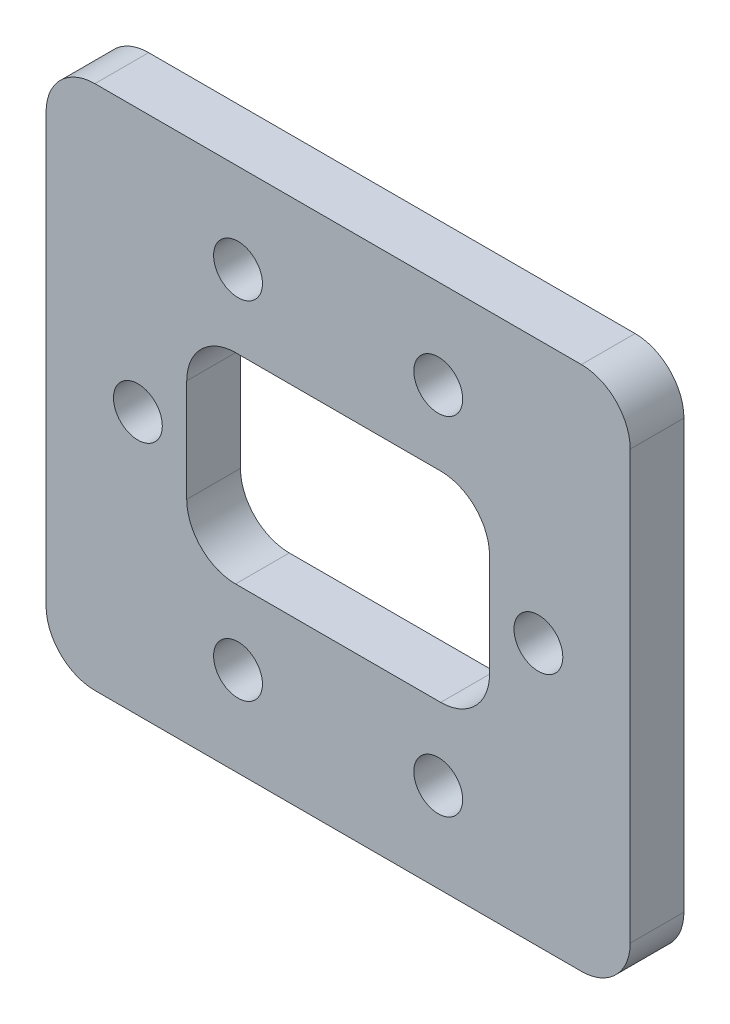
from build123d import *

# Parameters (mm, degrees)
SKETCH_1_R          = 2.5
EXTRUDE_1_DEPTH     = 5.5
CUT_EXTRUDE_START   = -10
CUT_EXTRUDE_1_DEPTH = 10


with BuildPart() as part:
    # Sketch 1 → Extrude 1 (new body)
    # profile 1 of 2: a face of its own
    with BuildSketch(Plane.XY):
        with BuildLine():
            Line((-28.87786877, 27.674760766), (30.92213123, 27.674760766))
            ThreePointArc((30.92213123, 27.674760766), (34.457665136, 26.210294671), (35.92213123, 22.674760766))
            Line((35.92213123, 22.674760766), (35.92213123, -21.125239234))
            ThreePointArc((35.92213123, -21.125239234), (34.457665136, -24.66077314), (30.92213123, -26.125239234))
            Line((30.92213123, -26.125239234), (-28.87786877, -26.125239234))
            ThreePointArc((-28.87786877, -26.125239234), (-32.413402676, -24.66077314), (-33.87786877, -21.125239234))
            Line((-33.87786877, -21.125239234), (-33.87786877, 22.674760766))
            ThreePointArc((-33.87786877, 22.674760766), (-32.413402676, 26.210294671), (-28.87786877, 27.674760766))
        make_face()
        with BuildLine():
            ThreePointArc((-14.47786877, 26.028281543), (-21.548936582, 23.099349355), (-24.47786877, 16.028281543))
            Line((-24.47786877, 16.028281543), (-24.47786877, -14.478760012))
            ThreePointArc((-24.47786877, -14.478760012), (-21.548936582, -21.549827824), (-14.47786877, -24.478760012))
            Line((-14.47786877, -24.478760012), (16.52213123, -24.478760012))
            ThreePointArc((16.52213123, -24.478760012), (23.593199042, -21.549827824), (26.52213123, -14.478760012))
            Line((26.52213123, -14.478760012), (26.52213123, 16.028281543))
            ThreePointArc((26.52213123, 16.028281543), (23.593199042, 23.099349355), (16.52213123, 26.028281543))
            Line((16.52213123, 26.028281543), (-14.47786877, 26.028281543))
        make_face(mode=Mode.SUBTRACT)
    # profile 2 of 2: a face of its own
    with BuildSketch(Plane.XY):
        with BuildLine():
            Line((-14.47786877, 26.028281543), (16.52213123, 26.028281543))
            ThreePointArc((16.52213123, 26.028281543), (23.593199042, 23.099349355), (26.52213123, 16.028281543))
            Line((26.52213123, 16.028281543), (26.52213123, -14.478760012))
            ThreePointArc((26.52213123, -14.478760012), (23.593199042, -21.549827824), (16.52213123, -24.478760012))
            Line((16.52213123, -24.478760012), (-14.47786877, -24.478760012))
            ThreePointArc((-14.47786877, -24.478760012), (-21.548936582, -21.549827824), (-24.47786877, -14.478760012))
            Line((-24.47786877, -14.478760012), (-24.47786877, 16.028281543))
            ThreePointArc((-24.47786877, 16.028281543), (-21.548936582, 23.099349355), (-14.47786877, 26.028281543))
        make_face()
        with Locations((-9.22786877, 18.528281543)):
            Circle(SKETCH_1_R, mode=Mode.SUBTRACT)
        with Locations((-9.22786877, -16.978760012)):
            Circle(SKETCH_1_R, mode=Mode.SUBTRACT)
        with Locations((11.27213123, -16.978760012)):
            Circle(SKETCH_1_R, mode=Mode.SUBTRACT)
        with Locations((11.27213123, 18.528281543)):
            Circle(SKETCH_1_R, mode=Mode.SUBTRACT)
        with Locations((21.52213123, 0.774760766)):
            Circle(SKETCH_1_R, mode=Mode.SUBTRACT)
        with Locations((-19.47786877, 0.774760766)):
            Circle(SKETCH_1_R, mode=Mode.SUBTRACT)
        with BuildLine():
            Line((-9.47786877, 11.028281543), (11.52213123, 11.028281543))
            ThreePointArc((11.52213123, 11.028281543), (15.057665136, 9.563815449), (16.52213123, 6.028281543))
            Line((16.52213123, 6.028281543), (16.52213123, -4.478760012))
            ThreePointArc((16.52213123, -4.478760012), (15.057665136, -8.014293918), (11.52213123, -9.478760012))
            Line((11.52213123, -9.478760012), (-9.47786877, -9.478760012))
            ThreePointArc((-9.47786877, -9.478760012), (-13.013402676, -8.014293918), (-14.47786877, -4.478760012))
            Line((-14.47786877, -4.478760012), (-14.47786877, 6.028281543))
            ThreePointArc((-14.47786877, 6.028281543), (-13.013402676, 9.563815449), (-9.47786877, 11.028281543))
        make_face(mode=Mode.SUBTRACT)
    extrude(amount=EXTRUDE_1_DEPTH)

    # Sketch 24 → Cut-Extrude 1 (cut)
    with BuildSketch(Plane.XY.offset(5.5).offset(CUT_EXTRUDE_START)):
        with BuildLine():
            Line((-28.87786877, -21.125239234), (-28.87786877, 22.674760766))
            ThreePointArc((-28.87786877, 22.674760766), (-27.413402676, 26.210294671), (-23.87786877, 27.674760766))
            Line((-23.87786877, 27.674760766), (-28.87786877, 27.674760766))
            ThreePointArc((-28.87786877, 27.674760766), (-32.413402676, 26.210294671), (-33.87786877, 22.674760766))
            Line((-33.87786877, 22.674760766), (-33.87786877, -21.125239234))
            ThreePointArc((-33.87786877, -21.125239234), (-32.413402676, -24.66077314), (-28.87786877, -26.125239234))
            Line((-28.87786877, -26.125239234), (-23.87786877, -26.125239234))
            ThreePointArc((-23.87786877, -26.125239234), (-27.413402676, -24.66077314), (-28.87786877, -21.125239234))
        make_face()
        with BuildLine():
            Line((30.92213123, 27.674760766), (25.92213123, 27.674760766))
            ThreePointArc((25.92213123, 27.674760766), (29.457665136, 26.210294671), (30.92213123, 22.674760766))
            Line((30.92213123, 22.674760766), (30.92213123, -21.125239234))
            ThreePointArc((30.92213123, -21.125239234), (29.457665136, -24.66077314), (25.92213123, -26.125239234))
            Line((25.92213123, -26.125239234), (30.92213123, -26.125239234))
            ThreePointArc((30.92213123, -26.125239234), (34.457665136, -24.66077314), (35.92213123, -21.125239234))
            Line((35.92213123, -21.125239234), (35.92213123, 22.674760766))
            ThreePointArc((35.92213123, 22.674760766), (34.457665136, 26.210294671), (30.92213123, 27.674760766))
        make_face()
    extrude(amount=CUT_EXTRUDE_1_DEPTH, mode=Mode.SUBTRACT)


solid = part.part
